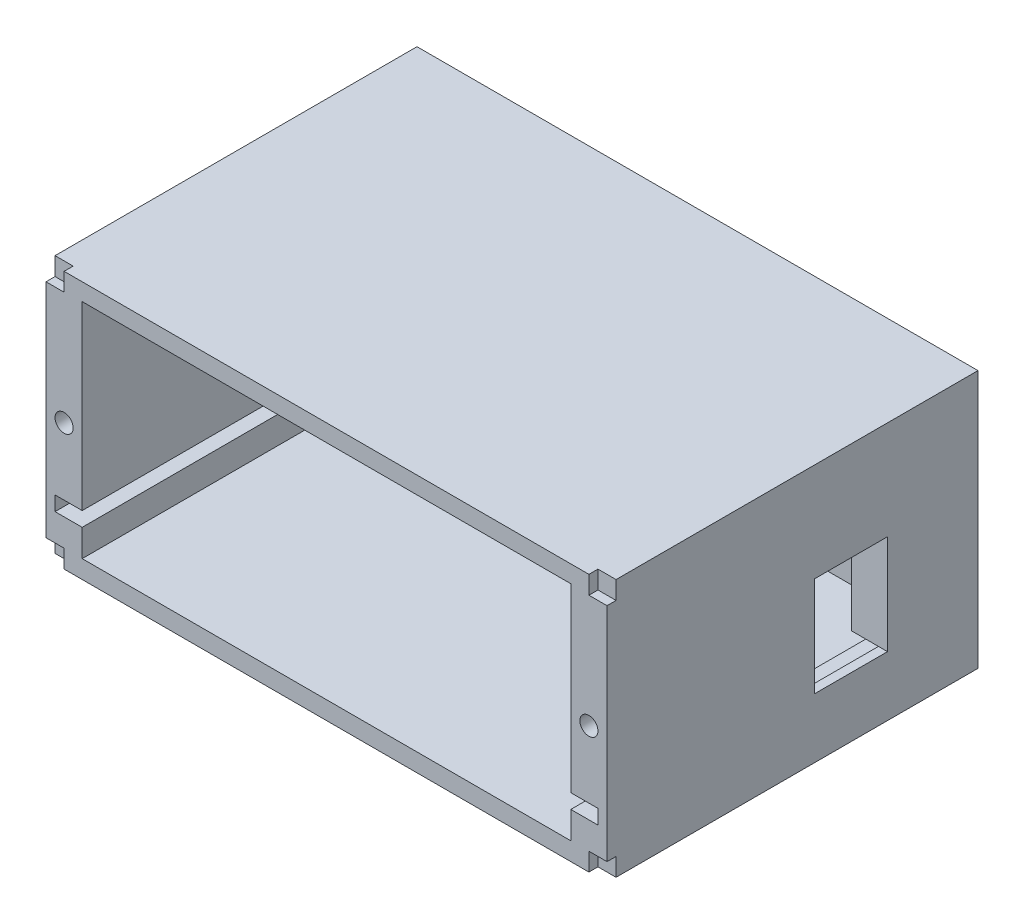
ISO-10303-21;
HEADER;
FILE_DESCRIPTION(('STEP AP214'),'2;1');
FILE_NAME('part.step','',(''),(''),'','','');
FILE_SCHEMA(('AUTOMOTIVE_DESIGN { 1 0 10303 214 1 1 1 1 }'));
ENDSEC;
DATA;
#1=APPLICATION_CONTEXT('core data for automotive mechanical design processes');
#2=APPLICATION_PROTOCOL_DEFINITION('international standard','automotive_design',2000,#1);
#3=PRODUCT_CONTEXT('',#1,'mechanical');
#4=PRODUCT('Part','Part','',(#3));
#5=PRODUCT_RELATED_PRODUCT_CATEGORY('part','',(#4));
#6=PRODUCT_DEFINITION_FORMATION('','',#4);
#7=PRODUCT_DEFINITION_CONTEXT('part definition',#1,'design');
#8=PRODUCT_DEFINITION('design','',#6,#7);
#9=PRODUCT_DEFINITION_SHAPE('','',#8);
#10=(LENGTH_UNIT() NAMED_UNIT(*) SI_UNIT(.MILLI.,.METRE.));
#11=(NAMED_UNIT(*) PLANE_ANGLE_UNIT() SI_UNIT($,.RADIAN.));
#12=(NAMED_UNIT(*) SI_UNIT($,.STERADIAN.) SOLID_ANGLE_UNIT());
#13=UNCERTAINTY_MEASURE_WITH_UNIT(LENGTH_MEASURE(1.E-05),#10,'distance_accuracy_value','');
#14=(GEOMETRIC_REPRESENTATION_CONTEXT(3) GLOBAL_UNCERTAINTY_ASSIGNED_CONTEXT((#13)) GLOBAL_UNIT_ASSIGNED_CONTEXT((#10,
#11,#12)) REPRESENTATION_CONTEXT('',''));
#15=CARTESIAN_POINT('',(0.,0.,0.));
#16=DIRECTION('',(0.,0.,1.));
#17=DIRECTION('',(1.,0.,0.));
#18=AXIS2_PLACEMENT_3D('',#15,#16,#17);
#19=CARTESIAN_POINT('',(-31.,0.,-41.));
#20=DIRECTION('',(0.,-1.,0.));
#21=DIRECTION('',(0.,0.,-1.));
#22=AXIS2_PLACEMENT_3D('',#19,#20,#21);
#23=PLANE('',#22);
#24=CARTESIAN_POINT('',(27.2034715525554,0.,-36.1384335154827));
#25=DIRECTION('',(0.,-1.,0.));
#26=DIRECTION('',(0.,0.,-1.));
#27=AXIS2_PLACEMENT_3D('',#24,#25,#26);
#28=CIRCLE('',#27,2.);
#29=CARTESIAN_POINT('',(27.2034715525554,0.,-38.1384335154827));
#30=VERTEX_POINT('',#29);
#31=EDGE_CURVE('E830',#30,#30,#28,.T.);
#32=ORIENTED_EDGE('',*,*,#31,.F.);
#33=EDGE_LOOP('',(#32));
#34=FACE_BOUND('',#33,.T.);
#35=CARTESIAN_POINT('',(-27.2034715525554,0.,-4.32406514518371));
#36=DIRECTION('',(0.,-1.,0.));
#37=DIRECTION('',(0.,0.,-1.));
#38=AXIS2_PLACEMENT_3D('',#35,#36,#37);
#39=CIRCLE('',#38,2.);
#40=CARTESIAN_POINT('',(-27.2034715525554,0.,-6.32406514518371));
#41=VERTEX_POINT('',#40);
#42=EDGE_CURVE('E823',#41,#41,#39,.T.);
#43=ORIENTED_EDGE('',*,*,#42,.F.);
#44=EDGE_LOOP('',(#43));
#45=FACE_BOUND('',#44,.T.);
#46=DIRECTION('',(0.,0.,1.));
#47=VECTOR('',#46,1.);
#48=CARTESIAN_POINT('',(29.,0.,-1.));
#49=LINE('',#48,#47);
#50=CARTESIAN_POINT('',(29.,0.,-1.));
#51=VERTEX_POINT('',#50);
#52=CARTESIAN_POINT('',(29.,0.,0.));
#53=VERTEX_POINT('',#52);
#54=EDGE_CURVE('E314',#51,#53,#49,.T.);
#55=ORIENTED_EDGE('',*,*,#54,.T.);
#56=DIRECTION('',(1.,0.,0.));
#57=VECTOR('',#56,1.);
#58=CARTESIAN_POINT('',(-31.,0.,0.));
#59=LINE('',#58,#57);
#60=CARTESIAN_POINT('',(-29.,0.,0.));
#61=VERTEX_POINT('',#60);
#62=EDGE_CURVE('E480',#61,#53,#59,.T.);
#63=ORIENTED_EDGE('',*,*,#62,.F.);
#64=DIRECTION('',(0.,0.,1.));
#65=VECTOR('',#64,1.);
#66=CARTESIAN_POINT('',(-29.,0.,-1.));
#67=LINE('',#66,#65);
#68=CARTESIAN_POINT('',(-29.,0.,-1.));
#69=VERTEX_POINT('',#68);
#70=EDGE_CURVE('E333',#69,#61,#67,.T.);
#71=ORIENTED_EDGE('',*,*,#70,.F.);
#72=DIRECTION('',(1.,0.,0.));
#73=VECTOR('',#72,1.);
#74=CARTESIAN_POINT('',(-31.,0.,-1.));
#75=LINE('',#74,#73);
#76=CARTESIAN_POINT('',(-31.,0.,-1.));
#77=VERTEX_POINT('',#76);
#78=EDGE_CURVE('E323',#77,#69,#75,.T.);
#79=ORIENTED_EDGE('',*,*,#78,.F.);
#80=DIRECTION('',(0.,0.,1.));
#81=VECTOR('',#80,1.);
#82=CARTESIAN_POINT('',(-31.,0.,-41.));
#83=LINE('',#82,#81);
#84=CARTESIAN_POINT('',(-31.,0.,-41.));
#85=VERTEX_POINT('',#84);
#86=EDGE_CURVE('E503',#85,#77,#83,.T.);
#87=ORIENTED_EDGE('',*,*,#86,.F.);
#88=DIRECTION('',(1.,0.,0.));
#89=VECTOR('',#88,1.);
#90=CARTESIAN_POINT('',(-31.,0.,-41.));
#91=LINE('',#90,#89);
#92=CARTESIAN_POINT('',(31.,0.,-41.));
#93=VERTEX_POINT('',#92);
#94=EDGE_CURVE('E486',#85,#93,#91,.T.);
#95=ORIENTED_EDGE('',*,*,#94,.T.);
#96=DIRECTION('',(0.,0.,1.));
#97=VECTOR('',#96,1.);
#98=CARTESIAN_POINT('',(31.,0.,-41.));
#99=LINE('',#98,#97);
#100=CARTESIAN_POINT('',(31.,0.,-1.));
#101=VERTEX_POINT('',#100);
#102=EDGE_CURVE('E499',#93,#101,#99,.T.);
#103=ORIENTED_EDGE('',*,*,#102,.T.);
#104=DIRECTION('',(1.,0.,0.));
#105=VECTOR('',#104,1.);
#106=CARTESIAN_POINT('',(31.,0.,-1.));
#107=LINE('',#106,#105);
#108=EDGE_CURVE('E308',#51,#101,#107,.T.);
#109=ORIENTED_EDGE('',*,*,#108,.F.);
#110=EDGE_LOOP('',(#55,#63,#71,#79,#87,#95,#103,#109));
#111=FACE_BOUND('',#110,.T.);
#112=CARTESIAN_POINT('',(-27.2034715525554,0.,-36.1384335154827));
#113=DIRECTION('',(0.,-1.,0.));
#114=DIRECTION('',(0.,0.,1.));
#115=AXIS2_PLACEMENT_3D('',#112,#113,#114);
#116=CIRCLE('',#115,2.);
#117=CARTESIAN_POINT('',(-27.2034715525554,0.,-34.1384335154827));
#118=VERTEX_POINT('',#117);
#119=EDGE_CURVE('E825',#118,#118,#116,.T.);
#120=ORIENTED_EDGE('',*,*,#119,.F.);
#121=EDGE_LOOP('',(#120));
#122=FACE_BOUND('',#121,.T.);
#123=CARTESIAN_POINT('',(27.2034715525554,0.,-4.32406514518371));
#124=DIRECTION('',(0.,-1.,0.));
#125=DIRECTION('',(0.,0.,1.));
#126=AXIS2_PLACEMENT_3D('',#123,#124,#125);
#127=CIRCLE('',#126,2.);
#128=CARTESIAN_POINT('',(27.2034715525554,0.,-2.32406514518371));
#129=VERTEX_POINT('',#128);
#130=EDGE_CURVE('E833',#129,#129,#127,.T.);
#131=ORIENTED_EDGE('',*,*,#130,.F.);
#132=EDGE_LOOP('',(#131));
#133=FACE_BOUND('',#132,.T.);
#134=ADVANCED_FACE('F31',(#34,#45,#111,#122,#133),#23,.T.);
#135=CARTESIAN_POINT('',(0.,6.6,-40.));
#136=DIRECTION('',(0.,1.,0.));
#137=DIRECTION('',(0.,0.,1.));
#138=AXIS2_PLACEMENT_3D('',#135,#136,#137);
#139=PLANE('',#138);
#140=DIRECTION('',(0.,0.,1.));
#141=VECTOR('',#140,1.);
#142=CARTESIAN_POINT('',(27.,6.6,-40.));
#143=LINE('',#142,#141);
#144=CARTESIAN_POINT('',(27.,6.6,-22.9381227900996));
#145=VERTEX_POINT('',#144);
#146=CARTESIAN_POINT('',(27.,6.6,0.));
#147=VERTEX_POINT('',#146);
#148=EDGE_CURVE('E452',#145,#147,#143,.T.);
#149=ORIENTED_EDGE('',*,*,#148,.F.);
#150=DIRECTION('',(1.,0.,0.));
#151=VECTOR('',#150,1.);
#152=CARTESIAN_POINT('',(25.5,6.6,-22.9381227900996));
#153=LINE('',#152,#151);
#154=CARTESIAN_POINT('',(30.,6.6,-22.9381227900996));
#155=VERTEX_POINT('',#154);
#156=EDGE_CURVE('E253',#145,#155,#153,.T.);
#157=ORIENTED_EDGE('',*,*,#156,.T.);
#158=DIRECTION('',(0.,0.,1.));
#159=VECTOR('',#158,1.);
#160=CARTESIAN_POINT('',(30.,6.6,-40.));
#161=LINE('',#160,#159);
#162=CARTESIAN_POINT('',(30.,6.6,0.));
#163=VERTEX_POINT('',#162);
#164=EDGE_CURVE('E457',#155,#163,#161,.T.);
#165=ORIENTED_EDGE('',*,*,#164,.T.);
#166=DIRECTION('',(-1.,0.,0.));
#167=VECTOR('',#166,1.);
#168=CARTESIAN_POINT('',(0.,6.6,0.));
#169=LINE('',#168,#167);
#170=EDGE_CURVE('E441',#163,#147,#169,.T.);
#171=ORIENTED_EDGE('',*,*,#170,.T.);
#172=EDGE_LOOP('',(#149,#157,#165,#171));
#173=FACE_BOUND('',#172,.T.);
#174=ADVANCED_FACE('F550',(#173),#139,.F.);
#175=CARTESIAN_POINT('',(31.,0.,-41.));
#176=DIRECTION('',(1.,0.,0.));
#177=DIRECTION('',(0.,0.,-1.));
#178=AXIS2_PLACEMENT_3D('',#175,#176,#177);
#179=PLANE('',#178);
#180=DIRECTION('',(0.,-1.,0.));
#181=VECTOR('',#180,1.);
#182=CARTESIAN_POINT('',(31.,14.25,-22.9381227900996));
#183=LINE('',#182,#181);
#184=CARTESIAN_POINT('',(31.,17.6,-22.9381227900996));
#185=VERTEX_POINT('',#184);
#186=CARTESIAN_POINT('',(31.,6.6,-22.9381227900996));
#187=VERTEX_POINT('',#186);
#188=EDGE_CURVE('E46',#185,#187,#183,.T.);
#189=ORIENTED_EDGE('',*,*,#188,.F.);
#190=DIRECTION('',(0.,0.,-1.));
#191=VECTOR('',#190,1.);
#192=CARTESIAN_POINT('',(31.,17.6,-31.));
#193=LINE('',#192,#191);
#194=CARTESIAN_POINT('',(31.,17.6,-31.));
#195=VERTEX_POINT('',#194);
#196=EDGE_CURVE('E264',#185,#195,#193,.T.);
#197=ORIENTED_EDGE('',*,*,#196,.T.);
#198=DIRECTION('',(0.,1.,0.));
#199=VECTOR('',#198,1.);
#200=CARTESIAN_POINT('',(31.,14.25,-31.));
#201=LINE('',#200,#199);
#202=CARTESIAN_POINT('',(31.,6.6,-31.));
#203=VERTEX_POINT('',#202);
#204=EDGE_CURVE('E54',#203,#195,#201,.T.);
#205=ORIENTED_EDGE('',*,*,#204,.F.);
#206=DIRECTION('',(0.,0.,-1.));
#207=VECTOR('',#206,1.);
#208=CARTESIAN_POINT('',(31.,6.6,-59.4797561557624));
#209=LINE('',#208,#207);
#210=EDGE_CURVE('E256',#187,#203,#209,.T.);
#211=ORIENTED_EDGE('',*,*,#210,.F.);
#212=EDGE_LOOP('',(#189,#197,#205,#211));
#213=FACE_BOUND('',#212,.T.);
#214=DIRECTION('',(0.,0.,1.));
#215=VECTOR('',#214,1.);
#216=CARTESIAN_POINT('',(31.,26.5,-1.));
#217=LINE('',#216,#215);
#218=CARTESIAN_POINT('',(31.,26.5,-1.));
#219=VERTEX_POINT('',#218);
#220=CARTESIAN_POINT('',(31.,26.5,0.));
#221=VERTEX_POINT('',#220);
#222=EDGE_CURVE('E291',#219,#221,#217,.T.);
#223=ORIENTED_EDGE('',*,*,#222,.T.);
#224=DIRECTION('',(0.,1.,0.));
#225=VECTOR('',#224,1.);
#226=CARTESIAN_POINT('',(31.,0.,0.));
#227=LINE('',#226,#225);
#228=CARTESIAN_POINT('',(31.,2.,0.));
#229=VERTEX_POINT('',#228);
#230=EDGE_CURVE('E448',#229,#221,#227,.T.);
#231=ORIENTED_EDGE('',*,*,#230,.F.);
#232=DIRECTION('',(0.,0.,1.));
#233=VECTOR('',#232,1.);
#234=CARTESIAN_POINT('',(31.,2.,-1.));
#235=LINE('',#234,#233);
#236=CARTESIAN_POINT('',(31.,2.,-1.));
#237=VERTEX_POINT('',#236);
#238=EDGE_CURVE('E310',#237,#229,#235,.T.);
#239=ORIENTED_EDGE('',*,*,#238,.F.);
#240=DIRECTION('',(0.,1.,0.));
#241=VECTOR('',#240,1.);
#242=CARTESIAN_POINT('',(31.,0.,-1.));
#243=LINE('',#242,#241);
#244=EDGE_CURVE('E298',#101,#237,#243,.T.);
#245=ORIENTED_EDGE('',*,*,#244,.F.);
#246=ORIENTED_EDGE('',*,*,#102,.F.);
#247=DIRECTION('',(0.,1.,0.));
#248=VECTOR('',#247,1.);
#249=CARTESIAN_POINT('',(31.,0.,-41.));
#250=LINE('',#249,#248);
#251=CARTESIAN_POINT('',(31.,28.5,-41.));
#252=VERTEX_POINT('',#251);
#253=EDGE_CURVE('E476',#93,#252,#250,.T.);
#254=ORIENTED_EDGE('',*,*,#253,.T.);
#255=DIRECTION('',(0.,0.,1.));
#256=VECTOR('',#255,1.);
#257=CARTESIAN_POINT('',(31.,28.5,-41.));
#258=LINE('',#257,#256);
#259=CARTESIAN_POINT('',(31.,28.5,-1.));
#260=VERTEX_POINT('',#259);
#261=EDGE_CURVE('E489',#252,#260,#258,.T.);
#262=ORIENTED_EDGE('',*,*,#261,.T.);
#263=DIRECTION('',(0.,1.,0.));
#264=VECTOR('',#263,1.);
#265=CARTESIAN_POINT('',(31.,28.5,-1.));
#266=LINE('',#265,#264);
#267=EDGE_CURVE('E275',#219,#260,#266,.T.);
#268=ORIENTED_EDGE('',*,*,#267,.F.);
#269=EDGE_LOOP('',(#223,#231,#239,#245,#246,#254,#262,#268));
#270=FACE_BOUND('',#269,.T.);
#271=ADVANCED_FACE('F261',(#213,#270),#179,.T.);
#272=CARTESIAN_POINT('',(-31.,0.,-41.));
#273=DIRECTION('',(-1.,0.,0.));
#274=DIRECTION('',(0.,0.,1.));
#275=AXIS2_PLACEMENT_3D('',#272,#273,#274);
#276=PLANE('',#275);
#277=DIRECTION('',(0.,0.,1.));
#278=VECTOR('',#277,1.);
#279=CARTESIAN_POINT('',(-31.,2.,-1.));
#280=LINE('',#279,#278);
#281=CARTESIAN_POINT('',(-31.,2.,-1.));
#282=VERTEX_POINT('',#281);
#283=CARTESIAN_POINT('',(-31.,2.,0.));
#284=VERTEX_POINT('',#283);
#285=EDGE_CURVE('E337',#282,#284,#280,.T.);
#286=ORIENTED_EDGE('',*,*,#285,.T.);
#287=DIRECTION('',(0.,-1.,0.));
#288=VECTOR('',#287,1.);
#289=CARTESIAN_POINT('',(-31.,0.,0.));
#290=LINE('',#289,#288);
#291=CARTESIAN_POINT('',(-31.,26.5,0.));
#292=VERTEX_POINT('',#291);
#293=EDGE_CURVE('E494',#292,#284,#290,.T.);
#294=ORIENTED_EDGE('',*,*,#293,.F.);
#295=DIRECTION('',(0.,0.,1.));
#296=VECTOR('',#295,1.);
#297=CARTESIAN_POINT('',(-31.,26.5,-1.));
#298=LINE('',#297,#296);
#299=CARTESIAN_POINT('',(-31.,26.5,-1.));
#300=VERTEX_POINT('',#299);
#301=EDGE_CURVE('E356',#300,#292,#298,.T.);
#302=ORIENTED_EDGE('',*,*,#301,.F.);
#303=DIRECTION('',(0.,-1.,0.));
#304=VECTOR('',#303,1.);
#305=CARTESIAN_POINT('',(-31.,28.5,-1.));
#306=LINE('',#305,#304);
#307=CARTESIAN_POINT('',(-31.,28.5,-1.));
#308=VERTEX_POINT('',#307);
#309=EDGE_CURVE('E344',#308,#300,#306,.T.);
#310=ORIENTED_EDGE('',*,*,#309,.F.);
#311=DIRECTION('',(0.,0.,1.));
#312=VECTOR('',#311,1.);
#313=CARTESIAN_POINT('',(-31.,28.5,-41.));
#314=LINE('',#313,#312);
#315=CARTESIAN_POINT('',(-31.,28.5,-41.));
#316=VERTEX_POINT('',#315);
#317=EDGE_CURVE('E506',#316,#308,#314,.T.);
#318=ORIENTED_EDGE('',*,*,#317,.F.);
#319=DIRECTION('',(0.,-1.,0.));
#320=VECTOR('',#319,1.);
#321=CARTESIAN_POINT('',(-31.,0.,-41.));
#322=LINE('',#321,#320);
#323=EDGE_CURVE('E483',#316,#85,#322,.T.);
#324=ORIENTED_EDGE('',*,*,#323,.T.);
#325=ORIENTED_EDGE('',*,*,#86,.T.);
#326=DIRECTION('',(0.,-1.,0.));
#327=VECTOR('',#326,1.);
#328=CARTESIAN_POINT('',(-31.,0.,-1.));
#329=LINE('',#328,#327);
#330=EDGE_CURVE('E321',#282,#77,#329,.T.);
#331=ORIENTED_EDGE('',*,*,#330,.F.);
#332=EDGE_LOOP('',(#286,#294,#302,#310,#318,#324,#325,#331));
#333=FACE_BOUND('',#332,.T.);
#334=ADVANCED_FACE('F565',(#333),#276,.T.);
#335=CARTESIAN_POINT('',(31.,28.5,-41.));
#336=DIRECTION('',(0.,1.,0.));
#337=DIRECTION('',(0.,0.,1.));
#338=AXIS2_PLACEMENT_3D('',#335,#336,#337);
#339=PLANE('',#338);
#340=DIRECTION('',(0.,0.,1.));
#341=VECTOR('',#340,1.);
#342=CARTESIAN_POINT('',(29.,28.5,-1.));
#343=LINE('',#342,#341);
#344=CARTESIAN_POINT('',(29.,28.5,-1.));
#345=VERTEX_POINT('',#344);
#346=CARTESIAN_POINT('',(29.,28.5,0.));
#347=VERTEX_POINT('',#346);
#348=EDGE_CURVE('E287',#345,#347,#343,.T.);
#349=ORIENTED_EDGE('',*,*,#348,.F.);
#350=DIRECTION('',(-1.,0.,0.));
#351=VECTOR('',#350,1.);
#352=CARTESIAN_POINT('',(31.,28.5,-1.));
#353=LINE('',#352,#351);
#354=EDGE_CURVE('E277',#260,#345,#353,.T.);
#355=ORIENTED_EDGE('',*,*,#354,.F.);
#356=ORIENTED_EDGE('',*,*,#261,.F.);
#357=DIRECTION('',(-1.,0.,0.));
#358=VECTOR('',#357,1.);
#359=CARTESIAN_POINT('',(31.,28.5,-41.));
#360=LINE('',#359,#358);
#361=EDGE_CURVE('E479',#252,#316,#360,.T.);
#362=ORIENTED_EDGE('',*,*,#361,.T.);
#363=ORIENTED_EDGE('',*,*,#317,.T.);
#364=DIRECTION('',(-1.,0.,0.));
#365=VECTOR('',#364,1.);
#366=CARTESIAN_POINT('',(-31.,28.5,-1.));
#367=LINE('',#366,#365);
#368=CARTESIAN_POINT('',(-29.,28.5,-1.));
#369=VERTEX_POINT('',#368);
#370=EDGE_CURVE('E354',#369,#308,#367,.T.);
#371=ORIENTED_EDGE('',*,*,#370,.F.);
#372=DIRECTION('',(0.,0.,1.));
#373=VECTOR('',#372,1.);
#374=CARTESIAN_POINT('',(-29.,28.5,-1.));
#375=LINE('',#374,#373);
#376=CARTESIAN_POINT('',(-29.,28.5,0.));
#377=VERTEX_POINT('',#376);
#378=EDGE_CURVE('E361',#369,#377,#375,.T.);
#379=ORIENTED_EDGE('',*,*,#378,.T.);
#380=DIRECTION('',(-1.,0.,0.));
#381=VECTOR('',#380,1.);
#382=CARTESIAN_POINT('',(31.,28.5,0.));
#383=LINE('',#382,#381);
#384=EDGE_CURVE('E492',#347,#377,#383,.T.);
#385=ORIENTED_EDGE('',*,*,#384,.F.);
#386=EDGE_LOOP('',(#349,#355,#356,#362,#363,#371,#379,#385));
#387=FACE_BOUND('',#386,.T.);
#388=ADVANCED_FACE('F568',(#387),#339,.T.);
#389=CARTESIAN_POINT('',(31.,28.5,-41.));
#390=DIRECTION('',(0.,0.,1.));
#391=DIRECTION('',(1.,0.,0.));
#392=AXIS2_PLACEMENT_3D('',#389,#390,#391);
#393=PLANE('',#392);
#394=ORIENTED_EDGE('',*,*,#253,.F.);
#395=ORIENTED_EDGE('',*,*,#94,.F.);
#396=ORIENTED_EDGE('',*,*,#323,.F.);
#397=ORIENTED_EDGE('',*,*,#361,.F.);
#398=EDGE_LOOP('',(#394,#395,#396,#397));
#399=FACE_BOUND('',#398,.T.);
#400=ADVANCED_FACE('F572',(#399),#393,.F.);
#401=CARTESIAN_POINT('',(31.,28.5,0.));
#402=DIRECTION('',(0.,0.,1.));
#403=DIRECTION('',(1.,0.,0.));
#404=AXIS2_PLACEMENT_3D('',#401,#402,#403);
#405=PLANE('',#404);
#406=DIRECTION('',(1.,0.,0.));
#407=VECTOR('',#406,1.);
#408=CARTESIAN_POINT('',(31.,26.5,0.));
#409=LINE('',#408,#407);
#410=CARTESIAN_POINT('',(29.,26.5,0.));
#411=VERTEX_POINT('',#410);
#412=EDGE_CURVE('E278',#411,#221,#409,.T.);
#413=ORIENTED_EDGE('',*,*,#412,.F.);
#414=DIRECTION('',(0.,-1.,0.));
#415=VECTOR('',#414,1.);
#416=CARTESIAN_POINT('',(29.,28.5,0.));
#417=LINE('',#416,#415);
#418=EDGE_CURVE('E274',#347,#411,#417,.T.);
#419=ORIENTED_EDGE('',*,*,#418,.F.);
#420=ORIENTED_EDGE('',*,*,#384,.T.);
#421=DIRECTION('',(0.,1.,0.));
#422=VECTOR('',#421,1.);
#423=CARTESIAN_POINT('',(-29.,28.5,0.));
#424=LINE('',#423,#422);
#425=CARTESIAN_POINT('',(-29.,26.5,0.));
#426=VERTEX_POINT('',#425);
#427=EDGE_CURVE('E348',#426,#377,#424,.T.);
#428=ORIENTED_EDGE('',*,*,#427,.F.);
#429=DIRECTION('',(1.,0.,0.));
#430=VECTOR('',#429,1.);
#431=CARTESIAN_POINT('',(-31.,26.5,0.));
#432=LINE('',#431,#430);
#433=EDGE_CURVE('E340',#292,#426,#432,.T.);
#434=ORIENTED_EDGE('',*,*,#433,.F.);
#435=ORIENTED_EDGE('',*,*,#293,.T.);
#436=DIRECTION('',(-1.,0.,0.));
#437=VECTOR('',#436,1.);
#438=CARTESIAN_POINT('',(-31.,2.,0.));
#439=LINE('',#438,#437);
#440=CARTESIAN_POINT('',(-29.,2.,0.));
#441=VERTEX_POINT('',#440);
#442=EDGE_CURVE('E324',#441,#284,#439,.T.);
#443=ORIENTED_EDGE('',*,*,#442,.F.);
#444=DIRECTION('',(0.,1.,0.));
#445=VECTOR('',#444,1.);
#446=CARTESIAN_POINT('',(-29.,0.,0.));
#447=LINE('',#446,#445);
#448=EDGE_CURVE('E317',#61,#441,#447,.T.);
#449=ORIENTED_EDGE('',*,*,#448,.F.);
#450=ORIENTED_EDGE('',*,*,#62,.T.);
#451=DIRECTION('',(0.,-1.,0.));
#452=VECTOR('',#451,1.);
#453=CARTESIAN_POINT('',(29.,0.,0.));
#454=LINE('',#453,#452);
#455=CARTESIAN_POINT('',(29.,2.,0.));
#456=VERTEX_POINT('',#455);
#457=EDGE_CURVE('E302',#456,#53,#454,.T.);
#458=ORIENTED_EDGE('',*,*,#457,.F.);
#459=DIRECTION('',(-1.,0.,0.));
#460=VECTOR('',#459,1.);
#461=CARTESIAN_POINT('',(31.,2.,0.));
#462=LINE('',#461,#460);
#463=EDGE_CURVE('E294',#229,#456,#462,.T.);
#464=ORIENTED_EDGE('',*,*,#463,.F.);
#465=ORIENTED_EDGE('',*,*,#230,.T.);
#466=EDGE_LOOP('',(#413,#419,#420,#428,#434,#435,#443,#449,#450,#458,#464,#465));
#467=FACE_BOUND('',#466,.T.);
#468=CARTESIAN_POINT('',(-29.,14.,0.));
#469=DIRECTION('',(0.,0.,1.));
#470=DIRECTION('',(1.,0.,0.));
#471=AXIS2_PLACEMENT_3D('',#468,#469,#470);
#472=CIRCLE('',#471,1.);
#473=CARTESIAN_POINT('',(-28.,14.,0.));
#474=VERTEX_POINT('',#473);
#475=EDGE_CURVE('E364',#474,#474,#472,.T.);
#476=ORIENTED_EDGE('',*,*,#475,.F.);
#477=EDGE_LOOP('',(#476));
#478=FACE_BOUND('',#477,.T.);
#479=CARTESIAN_POINT('',(29.,14.,0.));
#480=DIRECTION('',(0.,0.,1.));
#481=DIRECTION('',(1.,0.,0.));
#482=AXIS2_PLACEMENT_3D('',#479,#480,#481);
#483=CIRCLE('',#482,1.);
#484=CARTESIAN_POINT('',(30.,14.,0.));
#485=VERTEX_POINT('',#484);
#486=EDGE_CURVE('E371',#485,#485,#483,.T.);
#487=ORIENTED_EDGE('',*,*,#486,.F.);
#488=EDGE_LOOP('',(#487));
#489=FACE_BOUND('',#488,.T.);
#490=DIRECTION('',(-1.,0.,0.));
#491=VECTOR('',#490,1.);
#492=CARTESIAN_POINT('',(0.,26.6,0.));
#493=LINE('',#492,#491);
#494=CARTESIAN_POINT('',(27.,26.6,0.));
#495=VERTEX_POINT('',#494);
#496=CARTESIAN_POINT('',(-27.,26.6,0.));
#497=VERTEX_POINT('',#496);
#498=EDGE_CURVE('E377',#495,#497,#493,.T.);
#499=ORIENTED_EDGE('',*,*,#498,.F.);
#500=DIRECTION('',(0.,1.,0.));
#501=VECTOR('',#500,1.);
#502=CARTESIAN_POINT('',(27.,-38.967133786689,0.));
#503=LINE('',#502,#501);
#504=EDGE_CURVE('E384',#147,#495,#503,.T.);
#505=ORIENTED_EDGE('',*,*,#504,.F.);
#506=ORIENTED_EDGE('',*,*,#170,.F.);
#507=DIRECTION('',(0.,1.,0.));
#508=VECTOR('',#507,1.);
#509=CARTESIAN_POINT('',(30.,-38.967133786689,0.));
#510=LINE('',#509,#508);
#511=CARTESIAN_POINT('',(30.,5.,0.));
#512=VERTEX_POINT('',#511);
#513=EDGE_CURVE('E438',#512,#163,#510,.T.);
#514=ORIENTED_EDGE('',*,*,#513,.F.);
#515=DIRECTION('',(1.,0.,0.));
#516=VECTOR('',#515,1.);
#517=CARTESIAN_POINT('',(0.,5.,0.));
#518=LINE('',#517,#516);
#519=CARTESIAN_POINT('',(27.,5.,0.));
#520=VERTEX_POINT('',#519);
#521=EDGE_CURVE('E435',#520,#512,#518,.T.);
#522=ORIENTED_EDGE('',*,*,#521,.F.);
#523=DIRECTION('',(0.,1.,0.));
#524=VECTOR('',#523,1.);
#525=CARTESIAN_POINT('',(27.,-38.967133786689,0.));
#526=LINE('',#525,#524);
#527=CARTESIAN_POINT('',(27.,2.,0.));
#528=VERTEX_POINT('',#527);
#529=EDGE_CURVE('E432',#528,#520,#526,.T.);
#530=ORIENTED_EDGE('',*,*,#529,.F.);
#531=DIRECTION('',(1.,0.,0.));
#532=VECTOR('',#531,1.);
#533=CARTESIAN_POINT('',(0.,2.,0.));
#534=LINE('',#533,#532);
#535=CARTESIAN_POINT('',(-27.,2.,0.));
#536=VERTEX_POINT('',#535);
#537=EDGE_CURVE('E429',#536,#528,#534,.T.);
#538=ORIENTED_EDGE('',*,*,#537,.F.);
#539=DIRECTION('',(0.,1.,0.));
#540=VECTOR('',#539,1.);
#541=CARTESIAN_POINT('',(-27.,-38.967133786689,0.));
#542=LINE('',#541,#540);
#543=CARTESIAN_POINT('',(-27.,5.,0.));
#544=VERTEX_POINT('',#543);
#545=EDGE_CURVE('E426',#536,#544,#542,.T.);
#546=ORIENTED_EDGE('',*,*,#545,.T.);
#547=DIRECTION('',(-1.,0.,0.));
#548=VECTOR('',#547,1.);
#549=CARTESIAN_POINT('',(0.,5.,0.));
#550=LINE('',#549,#548);
#551=CARTESIAN_POINT('',(-30.,5.,0.));
#552=VERTEX_POINT('',#551);
#553=EDGE_CURVE('E423',#544,#552,#550,.T.);
#554=ORIENTED_EDGE('',*,*,#553,.T.);
#555=DIRECTION('',(0.,1.,0.));
#556=VECTOR('',#555,1.);
#557=CARTESIAN_POINT('',(-30.,-38.967133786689,0.));
#558=LINE('',#557,#556);
#559=CARTESIAN_POINT('',(-30.,6.6,0.));
#560=VERTEX_POINT('',#559);
#561=EDGE_CURVE('E420',#552,#560,#558,.T.);
#562=ORIENTED_EDGE('',*,*,#561,.T.);
#563=DIRECTION('',(1.,0.,0.));
#564=VECTOR('',#563,1.);
#565=CARTESIAN_POINT('',(0.,6.6,0.));
#566=LINE('',#565,#564);
#567=CARTESIAN_POINT('',(-27.,6.6,0.));
#568=VERTEX_POINT('',#567);
#569=EDGE_CURVE('E417',#560,#568,#566,.T.);
#570=ORIENTED_EDGE('',*,*,#569,.T.);
#571=DIRECTION('',(0.,1.,0.));
#572=VECTOR('',#571,1.);
#573=CARTESIAN_POINT('',(-27.,-38.967133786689,0.));
#574=LINE('',#573,#572);
#575=EDGE_CURVE('E414',#568,#497,#574,.T.);
#576=ORIENTED_EDGE('',*,*,#575,.T.);
#577=EDGE_LOOP('',(#499,#505,#506,#514,#522,#530,#538,#546,#554,#562,#570,#576));
#578=FACE_BOUND('',#577,.T.);
#579=ADVANCED_FACE('F563',(#467,#478,#489,#578),#405,.T.);
#580=CARTESIAN_POINT('',(0.,26.6,-40.));
#581=DIRECTION('',(0.,1.,0.));
#582=DIRECTION('',(0.,0.,1.));
#583=AXIS2_PLACEMENT_3D('',#580,#581,#582);
#584=PLANE('',#583);
#585=ORIENTED_EDGE('',*,*,#498,.T.);
#586=DIRECTION('',(0.,0.,1.));
#587=VECTOR('',#586,1.);
#588=CARTESIAN_POINT('',(-27.,26.6,-40.));
#589=LINE('',#588,#587);
#590=CARTESIAN_POINT('',(-27.,26.6,-40.));
#591=VERTEX_POINT('',#590);
#592=EDGE_CURVE('E412',#591,#497,#589,.T.);
#593=ORIENTED_EDGE('',*,*,#592,.F.);
#594=DIRECTION('',(-1.,0.,0.));
#595=VECTOR('',#594,1.);
#596=CARTESIAN_POINT('',(0.,26.6,-40.));
#597=LINE('',#596,#595);
#598=CARTESIAN_POINT('',(27.,26.6,-40.));
#599=VERTEX_POINT('',#598);
#600=EDGE_CURVE('E380',#599,#591,#597,.T.);
#601=ORIENTED_EDGE('',*,*,#600,.F.);
#602=DIRECTION('',(0.,0.,1.));
#603=VECTOR('',#602,1.);
#604=CARTESIAN_POINT('',(27.,26.6,-40.));
#605=LINE('',#604,#603);
#606=EDGE_CURVE('E446',#599,#495,#605,.T.);
#607=ORIENTED_EDGE('',*,*,#606,.T.);
#608=EDGE_LOOP('',(#585,#593,#601,#607));
#609=FACE_BOUND('',#608,.T.);
#610=ADVANCED_FACE('F703',(#609),#584,.F.);
#611=CARTESIAN_POINT('',(27.,-38.967133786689,-40.));
#612=DIRECTION('',(1.,0.,0.));
#613=DIRECTION('',(0.,0.,-1.));
#614=AXIS2_PLACEMENT_3D('',#611,#612,#613);
#615=PLANE('',#614);
#616=DIRECTION('',(0.,0.,1.));
#617=VECTOR('',#616,1.);
#618=CARTESIAN_POINT('',(27.,13.6000000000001,-59.4797561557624));
#619=LINE('',#618,#617);
#620=CARTESIAN_POINT('',(27.,13.6000000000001,-31.));
#621=VERTEX_POINT('',#620);
#622=CARTESIAN_POINT('',(27.,13.6000000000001,-22.9381227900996));
#623=VERTEX_POINT('',#622);
#624=EDGE_CURVE('E502',#621,#623,#619,.T.);
#625=ORIENTED_EDGE('',*,*,#624,.T.);
#626=DIRECTION('',(0.,-1.,0.));
#627=VECTOR('',#626,1.);
#628=CARTESIAN_POINT('',(27.,-38.967133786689,-22.9381227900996));
#629=LINE('',#628,#627);
#630=EDGE_CURVE('E271',#623,#145,#629,.T.);
#631=ORIENTED_EDGE('',*,*,#630,.T.);
#632=ORIENTED_EDGE('',*,*,#148,.T.);
#633=ORIENTED_EDGE('',*,*,#504,.T.);
#634=ORIENTED_EDGE('',*,*,#606,.F.);
#635=DIRECTION('',(0.,1.,0.));
#636=VECTOR('',#635,1.);
#637=CARTESIAN_POINT('',(27.,-38.967133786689,-40.));
#638=LINE('',#637,#636);
#639=CARTESIAN_POINT('',(27.,6.6,-40.));
#640=VERTEX_POINT('',#639);
#641=EDGE_CURVE('E409',#640,#599,#638,.T.);
#642=ORIENTED_EDGE('',*,*,#641,.F.);
#643=CARTESIAN_POINT('',(27.,6.6,-31.));
#644=VERTEX_POINT('',#643);
#645=EDGE_CURVE('E449',#640,#644,#143,.T.);
#646=ORIENTED_EDGE('',*,*,#645,.T.);
#647=DIRECTION('',(0.,1.,0.));
#648=VECTOR('',#647,1.);
#649=CARTESIAN_POINT('',(27.,-38.967133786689,-31.));
#650=LINE('',#649,#648);
#651=EDGE_CURVE('E269',#644,#621,#650,.T.);
#652=ORIENTED_EDGE('',*,*,#651,.T.);
#653=EDGE_LOOP('',(#625,#631,#632,#633,#634,#642,#646,#652));
#654=FACE_BOUND('',#653,.T.);
#655=ADVANCED_FACE('F701',(#654),#615,.F.);
#656=CARTESIAN_POINT('',(30.,6.6,-40.));
#657=VERTEX_POINT('',#656);
#658=CARTESIAN_POINT('',(30.,6.6,-31.));
#659=VERTEX_POINT('',#658);
#660=EDGE_CURVE('E453',#657,#659,#161,.T.);
#661=ORIENTED_EDGE('',*,*,#660,.T.);
#662=DIRECTION('',(1.,0.,0.));
#663=VECTOR('',#662,1.);
#664=CARTESIAN_POINT('',(25.5,6.6,-31.));
#665=LINE('',#664,#663);
#666=EDGE_CURVE('E250',#644,#659,#665,.T.);
#667=ORIENTED_EDGE('',*,*,#666,.F.);
#668=ORIENTED_EDGE('',*,*,#645,.F.);
#669=DIRECTION('',(-1.,0.,0.));
#670=VECTOR('',#669,1.);
#671=CARTESIAN_POINT('',(0.,6.6,-40.));
#672=LINE('',#671,#670);
#673=EDGE_CURVE('E406',#657,#640,#672,.T.);
#674=ORIENTED_EDGE('',*,*,#673,.F.);
#675=EDGE_LOOP('',(#661,#667,#668,#674));
#676=FACE_BOUND('',#675,.T.);
#677=ADVANCED_FACE('F558',(#676),#139,.F.);
#678=CARTESIAN_POINT('',(30.,-38.967133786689,-40.));
#679=DIRECTION('',(1.,0.,0.));
#680=DIRECTION('',(0.,0.,-1.));
#681=AXIS2_PLACEMENT_3D('',#678,#679,#680);
#682=PLANE('',#681);
#683=ORIENTED_EDGE('',*,*,#513,.T.);
#684=ORIENTED_EDGE('',*,*,#164,.F.);
#685=EDGE_CURVE('E456',#659,#155,#161,.T.);
#686=ORIENTED_EDGE('',*,*,#685,.F.);
#687=ORIENTED_EDGE('',*,*,#660,.F.);
#688=DIRECTION('',(0.,1.,0.));
#689=VECTOR('',#688,1.);
#690=CARTESIAN_POINT('',(30.,-38.967133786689,-40.));
#691=LINE('',#690,#689);
#692=CARTESIAN_POINT('',(30.,5.,-40.));
#693=VERTEX_POINT('',#692);
#694=EDGE_CURVE('E403',#693,#657,#691,.T.);
#695=ORIENTED_EDGE('',*,*,#694,.F.);
#696=DIRECTION('',(0.,0.,1.));
#697=VECTOR('',#696,1.);
#698=CARTESIAN_POINT('',(30.,5.,-40.));
#699=LINE('',#698,#697);
#700=EDGE_CURVE('E458',#693,#512,#699,.T.);
#701=ORIENTED_EDGE('',*,*,#700,.T.);
#702=EDGE_LOOP('',(#683,#684,#686,#687,#695,#701));
#703=FACE_BOUND('',#702,.T.);
#704=ADVANCED_FACE('F707',(#703),#682,.F.);
#705=CARTESIAN_POINT('',(0.,5.,-40.));
#706=DIRECTION('',(0.,-1.,0.));
#707=DIRECTION('',(0.,0.,-1.));
#708=AXIS2_PLACEMENT_3D('',#705,#706,#707);
#709=PLANE('',#708);
#710=ORIENTED_EDGE('',*,*,#521,.T.);
#711=ORIENTED_EDGE('',*,*,#700,.F.);
#712=DIRECTION('',(1.,0.,0.));
#713=VECTOR('',#712,1.);
#714=CARTESIAN_POINT('',(0.,5.,-40.));
#715=LINE('',#714,#713);
#716=CARTESIAN_POINT('',(27.,5.,-40.));
#717=VERTEX_POINT('',#716);
#718=EDGE_CURVE('E400',#717,#693,#715,.T.);
#719=ORIENTED_EDGE('',*,*,#718,.F.);
#720=DIRECTION('',(0.,0.,1.));
#721=VECTOR('',#720,1.);
#722=CARTESIAN_POINT('',(27.,5.,-40.));
#723=LINE('',#722,#721);
#724=EDGE_CURVE('E460',#717,#520,#723,.T.);
#725=ORIENTED_EDGE('',*,*,#724,.T.);
#726=EDGE_LOOP('',(#710,#711,#719,#725));
#727=FACE_BOUND('',#726,.T.);
#728=ADVANCED_FACE('F711',(#727),#709,.F.);
#729=CARTESIAN_POINT('',(27.,-38.967133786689,-40.));
#730=DIRECTION('',(1.,0.,0.));
#731=DIRECTION('',(0.,0.,-1.));
#732=AXIS2_PLACEMENT_3D('',#729,#730,#731);
#733=PLANE('',#732);
#734=ORIENTED_EDGE('',*,*,#529,.T.);
#735=ORIENTED_EDGE('',*,*,#724,.F.);
#736=DIRECTION('',(0.,1.,0.));
#737=VECTOR('',#736,1.);
#738=CARTESIAN_POINT('',(27.,-38.967133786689,-40.));
#739=LINE('',#738,#737);
#740=CARTESIAN_POINT('',(27.,2.,-40.));
#741=VERTEX_POINT('',#740);
#742=EDGE_CURVE('E397',#741,#717,#739,.T.);
#743=ORIENTED_EDGE('',*,*,#742,.F.);
#744=DIRECTION('',(0.,0.,1.));
#745=VECTOR('',#744,1.);
#746=CARTESIAN_POINT('',(27.,2.,-40.));
#747=LINE('',#746,#745);
#748=EDGE_CURVE('E462',#741,#528,#747,.T.);
#749=ORIENTED_EDGE('',*,*,#748,.T.);
#750=EDGE_LOOP('',(#734,#735,#743,#749));
#751=FACE_BOUND('',#750,.T.);
#752=ADVANCED_FACE('F715',(#751),#733,.F.);
#753=CARTESIAN_POINT('',(0.,2.,-40.));
#754=DIRECTION('',(0.,-1.,0.));
#755=DIRECTION('',(0.,0.,-1.));
#756=AXIS2_PLACEMENT_3D('',#753,#754,#755);
#757=PLANE('',#756);
#758=ORIENTED_EDGE('',*,*,#537,.T.);
#759=ORIENTED_EDGE('',*,*,#748,.F.);
#760=DIRECTION('',(1.,0.,0.));
#761=VECTOR('',#760,1.);
#762=CARTESIAN_POINT('',(0.,2.,-40.));
#763=LINE('',#762,#761);
#764=CARTESIAN_POINT('',(-27.,2.,-40.));
#765=VERTEX_POINT('',#764);
#766=EDGE_CURVE('E394',#765,#741,#763,.T.);
#767=ORIENTED_EDGE('',*,*,#766,.F.);
#768=DIRECTION('',(0.,0.,1.));
#769=VECTOR('',#768,1.);
#770=CARTESIAN_POINT('',(-27.,2.,-40.));
#771=LINE('',#770,#769);
#772=EDGE_CURVE('E464',#765,#536,#771,.T.);
#773=ORIENTED_EDGE('',*,*,#772,.T.);
#774=EDGE_LOOP('',(#758,#759,#767,#773));
#775=FACE_BOUND('',#774,.T.);
#776=ADVANCED_FACE('F719',(#775),#757,.F.);
#777=CARTESIAN_POINT('',(-27.,-38.967133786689,-40.));
#778=DIRECTION('',(1.,0.,0.));
#779=DIRECTION('',(0.,0.,-1.));
#780=AXIS2_PLACEMENT_3D('',#777,#778,#779);
#781=PLANE('',#780);
#782=ORIENTED_EDGE('',*,*,#545,.F.);
#783=ORIENTED_EDGE('',*,*,#772,.F.);
#784=DIRECTION('',(0.,1.,0.));
#785=VECTOR('',#784,1.);
#786=CARTESIAN_POINT('',(-27.,-38.967133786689,-40.));
#787=LINE('',#786,#785);
#788=CARTESIAN_POINT('',(-27.,5.,-40.));
#789=VERTEX_POINT('',#788);
#790=EDGE_CURVE('E392',#765,#789,#787,.T.);
#791=ORIENTED_EDGE('',*,*,#790,.T.);
#792=DIRECTION('',(0.,0.,1.));
#793=VECTOR('',#792,1.);
#794=CARTESIAN_POINT('',(-27.,5.,-40.));
#795=LINE('',#794,#793);
#796=EDGE_CURVE('E466',#789,#544,#795,.T.);
#797=ORIENTED_EDGE('',*,*,#796,.T.);
#798=EDGE_LOOP('',(#782,#783,#791,#797));
#799=FACE_BOUND('',#798,.T.);
#800=ADVANCED_FACE('F723',(#799),#781,.T.);
#801=CARTESIAN_POINT('',(0.,5.,-40.));
#802=DIRECTION('',(0.,1.,0.));
#803=DIRECTION('',(0.,0.,1.));
#804=AXIS2_PLACEMENT_3D('',#801,#802,#803);
#805=PLANE('',#804);
#806=ORIENTED_EDGE('',*,*,#553,.F.);
#807=ORIENTED_EDGE('',*,*,#796,.F.);
#808=DIRECTION('',(-1.,0.,0.));
#809=VECTOR('',#808,1.);
#810=CARTESIAN_POINT('',(0.,5.,-40.));
#811=LINE('',#810,#809);
#812=CARTESIAN_POINT('',(-30.,5.,-40.));
#813=VERTEX_POINT('',#812);
#814=EDGE_CURVE('E390',#789,#813,#811,.T.);
#815=ORIENTED_EDGE('',*,*,#814,.T.);
#816=DIRECTION('',(0.,0.,1.));
#817=VECTOR('',#816,1.);
#818=CARTESIAN_POINT('',(-30.,5.,-40.));
#819=LINE('',#818,#817);
#820=EDGE_CURVE('E468',#813,#552,#819,.T.);
#821=ORIENTED_EDGE('',*,*,#820,.T.);
#822=EDGE_LOOP('',(#806,#807,#815,#821));
#823=FACE_BOUND('',#822,.T.);
#824=ADVANCED_FACE('F727',(#823),#805,.T.);
#825=CARTESIAN_POINT('',(-30.,-38.967133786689,-40.));
#826=DIRECTION('',(1.,0.,0.));
#827=DIRECTION('',(0.,0.,-1.));
#828=AXIS2_PLACEMENT_3D('',#825,#826,#827);
#829=PLANE('',#828);
#830=ORIENTED_EDGE('',*,*,#561,.F.);
#831=ORIENTED_EDGE('',*,*,#820,.F.);
#832=DIRECTION('',(0.,1.,0.));
#833=VECTOR('',#832,1.);
#834=CARTESIAN_POINT('',(-30.,-38.967133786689,-40.));
#835=LINE('',#834,#833);
#836=CARTESIAN_POINT('',(-30.,6.6,-40.));
#837=VERTEX_POINT('',#836);
#838=EDGE_CURVE('E388',#813,#837,#835,.T.);
#839=ORIENTED_EDGE('',*,*,#838,.T.);
#840=DIRECTION('',(0.,0.,1.));
#841=VECTOR('',#840,1.);
#842=CARTESIAN_POINT('',(-30.,6.6,-40.));
#843=LINE('',#842,#841);
#844=EDGE_CURVE('E470',#837,#560,#843,.T.);
#845=ORIENTED_EDGE('',*,*,#844,.T.);
#846=EDGE_LOOP('',(#830,#831,#839,#845));
#847=FACE_BOUND('',#846,.T.);
#848=ADVANCED_FACE('F731',(#847),#829,.T.);
#849=CARTESIAN_POINT('',(0.,6.6,-40.));
#850=DIRECTION('',(0.,-1.,0.));
#851=DIRECTION('',(0.,0.,-1.));
#852=AXIS2_PLACEMENT_3D('',#849,#850,#851);
#853=PLANE('',#852);
#854=ORIENTED_EDGE('',*,*,#569,.F.);
#855=ORIENTED_EDGE('',*,*,#844,.F.);
#856=DIRECTION('',(1.,0.,0.));
#857=VECTOR('',#856,1.);
#858=CARTESIAN_POINT('',(0.,6.6,-40.));
#859=LINE('',#858,#857);
#860=CARTESIAN_POINT('',(-27.,6.6,-40.));
#861=VERTEX_POINT('',#860);
#862=EDGE_CURVE('E386',#837,#861,#859,.T.);
#863=ORIENTED_EDGE('',*,*,#862,.T.);
#864=DIRECTION('',(0.,0.,1.));
#865=VECTOR('',#864,1.);
#866=CARTESIAN_POINT('',(-27.,6.6,-40.));
#867=LINE('',#866,#865);
#868=EDGE_CURVE('E472',#861,#568,#867,.T.);
#869=ORIENTED_EDGE('',*,*,#868,.T.);
#870=EDGE_LOOP('',(#854,#855,#863,#869));
#871=FACE_BOUND('',#870,.T.);
#872=ADVANCED_FACE('F735',(#871),#853,.T.);
#873=CARTESIAN_POINT('',(-27.,-38.967133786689,-40.));
#874=DIRECTION('',(1.,0.,0.));
#875=DIRECTION('',(0.,0.,-1.));
#876=AXIS2_PLACEMENT_3D('',#873,#874,#875);
#877=PLANE('',#876);
#878=ORIENTED_EDGE('',*,*,#575,.F.);
#879=ORIENTED_EDGE('',*,*,#868,.F.);
#880=DIRECTION('',(0.,1.,0.));
#881=VECTOR('',#880,1.);
#882=CARTESIAN_POINT('',(-27.,-38.967133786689,-40.));
#883=LINE('',#882,#881);
#884=EDGE_CURVE('E383',#861,#591,#883,.T.);
#885=ORIENTED_EDGE('',*,*,#884,.T.);
#886=ORIENTED_EDGE('',*,*,#592,.T.);
#887=EDGE_LOOP('',(#878,#879,#885,#886));
#888=FACE_BOUND('',#887,.T.);
#889=ADVANCED_FACE('F699',(#888),#877,.T.);
#890=CARTESIAN_POINT('',(0.,-38.967133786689,-40.));
#891=DIRECTION('',(0.,0.,1.));
#892=DIRECTION('',(1.,0.,0.));
#893=AXIS2_PLACEMENT_3D('',#890,#891,#892);
#894=PLANE('',#893);
#895=ORIENTED_EDGE('',*,*,#600,.T.);
#896=ORIENTED_EDGE('',*,*,#884,.F.);
#897=ORIENTED_EDGE('',*,*,#862,.F.);
#898=ORIENTED_EDGE('',*,*,#838,.F.);
#899=ORIENTED_EDGE('',*,*,#814,.F.);
#900=ORIENTED_EDGE('',*,*,#790,.F.);
#901=ORIENTED_EDGE('',*,*,#766,.T.);
#902=ORIENTED_EDGE('',*,*,#742,.T.);
#903=ORIENTED_EDGE('',*,*,#718,.T.);
#904=ORIENTED_EDGE('',*,*,#694,.T.);
#905=ORIENTED_EDGE('',*,*,#673,.T.);
#906=ORIENTED_EDGE('',*,*,#641,.T.);
#907=EDGE_LOOP('',(#895,#896,#897,#898,#899,#900,#901,#902,#903,#904,#905,#906));
#908=FACE_BOUND('',#907,.T.);
#909=ADVANCED_FACE('F695',(#908),#894,.T.);
#910=CARTESIAN_POINT('',(29.,14.,-10.));
#911=DIRECTION('',(0.,0.,1.));
#912=DIRECTION('',(1.,0.,0.));
#913=AXIS2_PLACEMENT_3D('',#910,#911,#912);
#914=CYLINDRICAL_SURFACE('',#913,1.);
#915=CARTESIAN_POINT('',(29.,14.,-10.));
#916=DIRECTION('',(0.,0.,1.));
#917=DIRECTION('',(1.,0.,0.));
#918=AXIS2_PLACEMENT_3D('',#915,#916,#917);
#919=CIRCLE('',#918,1.);
#920=CARTESIAN_POINT('',(30.,14.,-10.));
#921=VERTEX_POINT('',#920);
#922=EDGE_CURVE('E374',#921,#921,#919,.T.);
#923=ORIENTED_EDGE('',*,*,#922,.F.);
#924=EDGE_LOOP('',(#923));
#925=FACE_BOUND('',#924,.T.);
#926=ORIENTED_EDGE('',*,*,#486,.T.);
#927=EDGE_LOOP('',(#926));
#928=FACE_BOUND('',#927,.T.);
#929=ADVANCED_FACE('F691',(#925,#928),#914,.F.);
#930=CARTESIAN_POINT('',(29.,14.,-10.));
#931=DIRECTION('',(0.,0.,1.));
#932=DIRECTION('',(1.,0.,0.));
#933=AXIS2_PLACEMENT_3D('',#930,#931,#932);
#934=PLANE('',#933);
#935=ORIENTED_EDGE('',*,*,#922,.T.);
#936=EDGE_LOOP('',(#935));
#937=FACE_BOUND('',#936,.T.);
#938=ADVANCED_FACE('F687',(#937),#934,.T.);
#939=CARTESIAN_POINT('',(-29.,14.,-10.));
#940=DIRECTION('',(0.,0.,1.));
#941=DIRECTION('',(1.,0.,0.));
#942=AXIS2_PLACEMENT_3D('',#939,#940,#941);
#943=CYLINDRICAL_SURFACE('',#942,1.);
#944=CARTESIAN_POINT('',(-29.,14.,-10.));
#945=DIRECTION('',(0.,0.,1.));
#946=DIRECTION('',(1.,0.,0.));
#947=AXIS2_PLACEMENT_3D('',#944,#945,#946);
#948=CIRCLE('',#947,1.);
#949=CARTESIAN_POINT('',(-28.,14.,-10.));
#950=VERTEX_POINT('',#949);
#951=EDGE_CURVE('E368',#950,#950,#948,.T.);
#952=ORIENTED_EDGE('',*,*,#951,.F.);
#953=EDGE_LOOP('',(#952));
#954=FACE_BOUND('',#953,.T.);
#955=ORIENTED_EDGE('',*,*,#475,.T.);
#956=EDGE_LOOP('',(#955));
#957=FACE_BOUND('',#956,.T.);
#958=ADVANCED_FACE('F683',(#954,#957),#943,.F.);
#959=CARTESIAN_POINT('',(-29.,14.,-10.));
#960=DIRECTION('',(0.,0.,1.));
#961=DIRECTION('',(1.,0.,0.));
#962=AXIS2_PLACEMENT_3D('',#959,#960,#961);
#963=PLANE('',#962);
#964=ORIENTED_EDGE('',*,*,#951,.T.);
#965=EDGE_LOOP('',(#964));
#966=FACE_BOUND('',#965,.T.);
#967=ADVANCED_FACE('F676',(#966),#963,.T.);
#968=CARTESIAN_POINT('',(-29.,28.5,-1.));
#969=DIRECTION('',(1.,0.,0.));
#970=DIRECTION('',(0.,0.,-1.));
#971=AXIS2_PLACEMENT_3D('',#968,#969,#970);
#972=PLANE('',#971);
#973=ORIENTED_EDGE('',*,*,#427,.T.);
#974=ORIENTED_EDGE('',*,*,#378,.F.);
#975=DIRECTION('',(0.,1.,0.));
#976=VECTOR('',#975,1.);
#977=CARTESIAN_POINT('',(-29.,28.5,-1.));
#978=LINE('',#977,#976);
#979=CARTESIAN_POINT('',(-29.,26.5,-1.));
#980=VERTEX_POINT('',#979);
#981=EDGE_CURVE('E351',#980,#369,#978,.T.);
#982=ORIENTED_EDGE('',*,*,#981,.F.);
#983=DIRECTION('',(0.,0.,1.));
#984=VECTOR('',#983,1.);
#985=CARTESIAN_POINT('',(-29.,26.5,-1.));
#986=LINE('',#985,#984);
#987=EDGE_CURVE('E365',#980,#426,#986,.T.);
#988=ORIENTED_EDGE('',*,*,#987,.T.);
#989=EDGE_LOOP('',(#973,#974,#982,#988));
#990=FACE_BOUND('',#989,.T.);
#991=ADVANCED_FACE('F673',(#990),#972,.F.);
#992=CARTESIAN_POINT('',(-31.,26.5,-1.));
#993=DIRECTION('',(0.,-1.,0.));
#994=DIRECTION('',(0.,0.,-1.));
#995=AXIS2_PLACEMENT_3D('',#992,#993,#994);
#996=PLANE('',#995);
#997=ORIENTED_EDGE('',*,*,#433,.T.);
#998=ORIENTED_EDGE('',*,*,#987,.F.);
#999=DIRECTION('',(1.,0.,0.));
#1000=VECTOR('',#999,1.);
#1001=CARTESIAN_POINT('',(-31.,26.5,-1.));
#1002=LINE('',#1001,#1000);
#1003=EDGE_CURVE('E347',#300,#980,#1002,.T.);
#1004=ORIENTED_EDGE('',*,*,#1003,.F.);
#1005=ORIENTED_EDGE('',*,*,#301,.T.);
#1006=EDGE_LOOP('',(#997,#998,#1004,#1005));
#1007=FACE_BOUND('',#1006,.T.);
#1008=ADVANCED_FACE('F671',(#1007),#996,.F.);
#1009=CARTESIAN_POINT('',(-31.,26.5,-1.));
#1010=DIRECTION('',(0.,0.,1.));
#1011=DIRECTION('',(1.,0.,0.));
#1012=AXIS2_PLACEMENT_3D('',#1009,#1010,#1011);
#1013=PLANE('',#1012);
#1014=ORIENTED_EDGE('',*,*,#309,.T.);
#1015=ORIENTED_EDGE('',*,*,#1003,.T.);
#1016=ORIENTED_EDGE('',*,*,#981,.T.);
#1017=ORIENTED_EDGE('',*,*,#370,.T.);
#1018=EDGE_LOOP('',(#1014,#1015,#1016,#1017));
#1019=FACE_BOUND('',#1018,.T.);
#1020=ADVANCED_FACE('F664',(#1019),#1013,.T.);
#1021=CARTESIAN_POINT('',(-31.,2.,-1.));
#1022=DIRECTION('',(0.,1.,0.));
#1023=DIRECTION('',(0.,0.,1.));
#1024=AXIS2_PLACEMENT_3D('',#1021,#1022,#1023);
#1025=PLANE('',#1024);
#1026=ORIENTED_EDGE('',*,*,#442,.T.);
#1027=ORIENTED_EDGE('',*,*,#285,.F.);
#1028=DIRECTION('',(-1.,0.,0.));
#1029=VECTOR('',#1028,1.);
#1030=CARTESIAN_POINT('',(-31.,2.,-1.));
#1031=LINE('',#1030,#1029);
#1032=CARTESIAN_POINT('',(-29.,2.,-1.));
#1033=VERTEX_POINT('',#1032);
#1034=EDGE_CURVE('E330',#1033,#282,#1031,.T.);
#1035=ORIENTED_EDGE('',*,*,#1034,.F.);
#1036=DIRECTION('',(0.,0.,1.));
#1037=VECTOR('',#1036,1.);
#1038=CARTESIAN_POINT('',(-29.,2.,-1.));
#1039=LINE('',#1038,#1037);
#1040=EDGE_CURVE('E341',#1033,#441,#1039,.T.);
#1041=ORIENTED_EDGE('',*,*,#1040,.T.);
#1042=EDGE_LOOP('',(#1026,#1027,#1035,#1041));
#1043=FACE_BOUND('',#1042,.T.);
#1044=ADVANCED_FACE('F661',(#1043),#1025,.F.);
#1045=CARTESIAN_POINT('',(-29.,0.,-1.));
#1046=DIRECTION('',(1.,0.,0.));
#1047=DIRECTION('',(0.,0.,-1.));
#1048=AXIS2_PLACEMENT_3D('',#1045,#1046,#1047);
#1049=PLANE('',#1048);
#1050=ORIENTED_EDGE('',*,*,#448,.T.);
#1051=ORIENTED_EDGE('',*,*,#1040,.F.);
#1052=DIRECTION('',(0.,1.,0.));
#1053=VECTOR('',#1052,1.);
#1054=CARTESIAN_POINT('',(-29.,0.,-1.));
#1055=LINE('',#1054,#1053);
#1056=EDGE_CURVE('E327',#69,#1033,#1055,.T.);
#1057=ORIENTED_EDGE('',*,*,#1056,.F.);
#1058=ORIENTED_EDGE('',*,*,#70,.T.);
#1059=EDGE_LOOP('',(#1050,#1051,#1057,#1058));
#1060=FACE_BOUND('',#1059,.T.);
#1061=ADVANCED_FACE('F659',(#1060),#1049,.F.);
#1062=CARTESIAN_POINT('',(-31.,2.,-1.));
#1063=DIRECTION('',(0.,0.,-1.));
#1064=DIRECTION('',(-1.,0.,0.));
#1065=AXIS2_PLACEMENT_3D('',#1062,#1063,#1064);
#1066=PLANE('',#1065);
#1067=ORIENTED_EDGE('',*,*,#330,.T.);
#1068=ORIENTED_EDGE('',*,*,#78,.T.);
#1069=ORIENTED_EDGE('',*,*,#1056,.T.);
#1070=ORIENTED_EDGE('',*,*,#1034,.T.);
#1071=EDGE_LOOP('',(#1067,#1068,#1069,#1070));
#1072=FACE_BOUND('',#1071,.T.);
#1073=ADVANCED_FACE('F652',(#1072),#1066,.F.);
#1074=CARTESIAN_POINT('',(29.,0.,-1.));
#1075=DIRECTION('',(-1.,0.,0.));
#1076=DIRECTION('',(0.,0.,1.));
#1077=AXIS2_PLACEMENT_3D('',#1074,#1075,#1076);
#1078=PLANE('',#1077);
#1079=ORIENTED_EDGE('',*,*,#457,.T.);
#1080=ORIENTED_EDGE('',*,*,#54,.F.);
#1081=DIRECTION('',(0.,-1.,0.));
#1082=VECTOR('',#1081,1.);
#1083=CARTESIAN_POINT('',(29.,0.,-1.));
#1084=LINE('',#1083,#1082);
#1085=CARTESIAN_POINT('',(29.,2.,-1.));
#1086=VERTEX_POINT('',#1085);
#1087=EDGE_CURVE('E305',#1086,#51,#1084,.T.);
#1088=ORIENTED_EDGE('',*,*,#1087,.F.);
#1089=DIRECTION('',(0.,0.,1.));
#1090=VECTOR('',#1089,1.);
#1091=CARTESIAN_POINT('',(29.,2.,-1.));
#1092=LINE('',#1091,#1090);
#1093=EDGE_CURVE('E318',#1086,#456,#1092,.T.);
#1094=ORIENTED_EDGE('',*,*,#1093,.T.);
#1095=EDGE_LOOP('',(#1079,#1080,#1088,#1094));
#1096=FACE_BOUND('',#1095,.T.);
#1097=ADVANCED_FACE('F649',(#1096),#1078,.F.);
#1098=CARTESIAN_POINT('',(31.,2.,-1.));
#1099=DIRECTION('',(0.,1.,0.));
#1100=DIRECTION('',(-1.,0.,0.));
#1101=AXIS2_PLACEMENT_3D('',#1098,#1099,#1100);
#1102=PLANE('',#1101);
#1103=ORIENTED_EDGE('',*,*,#463,.T.);
#1104=ORIENTED_EDGE('',*,*,#1093,.F.);
#1105=DIRECTION('',(-1.,0.,0.));
#1106=VECTOR('',#1105,1.);
#1107=CARTESIAN_POINT('',(31.,2.,-1.));
#1108=LINE('',#1107,#1106);
#1109=EDGE_CURVE('E301',#237,#1086,#1108,.T.);
#1110=ORIENTED_EDGE('',*,*,#1109,.F.);
#1111=ORIENTED_EDGE('',*,*,#238,.T.);
#1112=EDGE_LOOP('',(#1103,#1104,#1110,#1111));
#1113=FACE_BOUND('',#1112,.T.);
#1114=ADVANCED_FACE('F647',(#1113),#1102,.F.);
#1115=CARTESIAN_POINT('',(31.,0.,-1.));
#1116=DIRECTION('',(0.,0.,1.));
#1117=DIRECTION('',(1.,0.,0.));
#1118=AXIS2_PLACEMENT_3D('',#1115,#1116,#1117);
#1119=PLANE('',#1118);
#1120=ORIENTED_EDGE('',*,*,#244,.T.);
#1121=ORIENTED_EDGE('',*,*,#1109,.T.);
#1122=ORIENTED_EDGE('',*,*,#1087,.T.);
#1123=ORIENTED_EDGE('',*,*,#108,.T.);
#1124=EDGE_LOOP('',(#1120,#1121,#1122,#1123));
#1125=FACE_BOUND('',#1124,.T.);
#1126=ADVANCED_FACE('F640',(#1125),#1119,.T.);
#1127=CARTESIAN_POINT('',(31.,26.5,-1.));
#1128=DIRECTION('',(0.,-1.,0.));
#1129=DIRECTION('',(0.,0.,-1.));
#1130=AXIS2_PLACEMENT_3D('',#1127,#1128,#1129);
#1131=PLANE('',#1130);
#1132=ORIENTED_EDGE('',*,*,#412,.T.);
#1133=ORIENTED_EDGE('',*,*,#222,.F.);
#1134=DIRECTION('',(1.,0.,0.));
#1135=VECTOR('',#1134,1.);
#1136=CARTESIAN_POINT('',(31.,26.5,-1.));
#1137=LINE('',#1136,#1135);
#1138=CARTESIAN_POINT('',(29.,26.5,-1.));
#1139=VERTEX_POINT('',#1138);
#1140=EDGE_CURVE('E284',#1139,#219,#1137,.T.);
#1141=ORIENTED_EDGE('',*,*,#1140,.F.);
#1142=DIRECTION('',(0.,0.,1.));
#1143=VECTOR('',#1142,1.);
#1144=CARTESIAN_POINT('',(29.,26.5,-1.));
#1145=LINE('',#1144,#1143);
#1146=EDGE_CURVE('E295',#1139,#411,#1145,.T.);
#1147=ORIENTED_EDGE('',*,*,#1146,.T.);
#1148=EDGE_LOOP('',(#1132,#1133,#1141,#1147));
#1149=FACE_BOUND('',#1148,.T.);
#1150=ADVANCED_FACE('F637',(#1149),#1131,.F.);
#1151=CARTESIAN_POINT('',(29.,28.5,-1.));
#1152=DIRECTION('',(-1.,0.,0.));
#1153=DIRECTION('',(0.,0.,1.));
#1154=AXIS2_PLACEMENT_3D('',#1151,#1152,#1153);
#1155=PLANE('',#1154);
#1156=ORIENTED_EDGE('',*,*,#418,.T.);
#1157=ORIENTED_EDGE('',*,*,#1146,.F.);
#1158=DIRECTION('',(0.,-1.,0.));
#1159=VECTOR('',#1158,1.);
#1160=CARTESIAN_POINT('',(29.,28.5,-1.));
#1161=LINE('',#1160,#1159);
#1162=EDGE_CURVE('E281',#345,#1139,#1161,.T.);
#1163=ORIENTED_EDGE('',*,*,#1162,.F.);
#1164=ORIENTED_EDGE('',*,*,#348,.T.);
#1165=EDGE_LOOP('',(#1156,#1157,#1163,#1164));
#1166=FACE_BOUND('',#1165,.T.);
#1167=ADVANCED_FACE('F635',(#1166),#1155,.F.);
#1168=CARTESIAN_POINT('',(31.,26.5,-1.));
#1169=DIRECTION('',(0.,0.,-1.));
#1170=DIRECTION('',(-1.,0.,0.));
#1171=AXIS2_PLACEMENT_3D('',#1168,#1169,#1170);
#1172=PLANE('',#1171);
#1173=ORIENTED_EDGE('',*,*,#267,.T.);
#1174=ORIENTED_EDGE('',*,*,#354,.T.);
#1175=ORIENTED_EDGE('',*,*,#1162,.T.);
#1176=ORIENTED_EDGE('',*,*,#1140,.T.);
#1177=EDGE_LOOP('',(#1173,#1174,#1175,#1176));
#1178=FACE_BOUND('',#1177,.T.);
#1179=ADVANCED_FACE('F631',(#1178),#1172,.F.);
#1180=CARTESIAN_POINT('',(25.5,14.25,-22.9381227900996));
#1181=DIRECTION('',(0.,0.,1.));
#1182=DIRECTION('',(1.,0.,0.));
#1183=AXIS2_PLACEMENT_3D('',#1180,#1181,#1182);
#1184=PLANE('',#1183);
#1185=ORIENTED_EDGE('',*,*,#630,.F.);
#1186=DIRECTION('',(0.707106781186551,0.707106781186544,0.));
#1187=VECTOR('',#1186,1.);
#1188=CARTESIAN_POINT('',(26.575,13.175,-22.9381227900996));
#1189=LINE('',#1188,#1187);
#1190=EDGE_CURVE('E514',#623,#185,#1189,.T.);
#1191=ORIENTED_EDGE('',*,*,#1190,.T.);
#1192=ORIENTED_EDGE('',*,*,#188,.T.);
#1193=EDGE_CURVE('E259',#155,#187,#153,.T.);
#1194=ORIENTED_EDGE('',*,*,#1193,.F.);
#1195=ORIENTED_EDGE('',*,*,#156,.F.);
#1196=EDGE_LOOP('',(#1185,#1191,#1192,#1194,#1195));
#1197=FACE_BOUND('',#1196,.T.);
#1198=ADVANCED_FACE('F626',(#1197),#1184,.F.);
#1199=CARTESIAN_POINT('',(25.5,14.25,-31.));
#1200=DIRECTION('',(0.,0.,-1.));
#1201=DIRECTION('',(-1.,0.,0.));
#1202=AXIS2_PLACEMENT_3D('',#1199,#1200,#1201);
#1203=PLANE('',#1202);
#1204=ORIENTED_EDGE('',*,*,#666,.T.);
#1205=EDGE_CURVE('E246',#659,#203,#665,.T.);
#1206=ORIENTED_EDGE('',*,*,#1205,.T.);
#1207=ORIENTED_EDGE('',*,*,#204,.T.);
#1208=DIRECTION('',(-0.707106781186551,-0.707106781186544,0.));
#1209=VECTOR('',#1208,1.);
#1210=CARTESIAN_POINT('',(26.575,13.175,-31.));
#1211=LINE('',#1210,#1209);
#1212=EDGE_CURVE('E516',#195,#621,#1211,.T.);
#1213=ORIENTED_EDGE('',*,*,#1212,.T.);
#1214=ORIENTED_EDGE('',*,*,#651,.F.);
#1215=EDGE_LOOP('',(#1204,#1206,#1207,#1213,#1214));
#1216=FACE_BOUND('',#1215,.T.);
#1217=ADVANCED_FACE('F248',(#1216),#1203,.F.);
#1218=CARTESIAN_POINT('',(25.5,6.6,-59.4797561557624));
#1219=DIRECTION('',(0.,-1.,0.));
#1220=DIRECTION('',(0.,0.,-1.));
#1221=AXIS2_PLACEMENT_3D('',#1218,#1219,#1220);
#1222=PLANE('',#1221);
#1223=ORIENTED_EDGE('',*,*,#1193,.T.);
#1224=ORIENTED_EDGE('',*,*,#210,.T.);
#1225=ORIENTED_EDGE('',*,*,#1205,.F.);
#1226=ORIENTED_EDGE('',*,*,#685,.T.);
#1227=EDGE_LOOP('',(#1223,#1224,#1225,#1226));
#1228=FACE_BOUND('',#1227,.T.);
#1229=ADVANCED_FACE('F257',(#1228),#1222,.F.);
#1230=CARTESIAN_POINT('',(25.9999999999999,12.6,-59.4797561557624));
#1231=DIRECTION('',(0.707106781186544,-0.707106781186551,0.));
#1232=DIRECTION('',(0.707106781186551,0.707106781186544,0.));
#1233=AXIS2_PLACEMENT_3D('',#1230,#1231,#1232);
#1234=PLANE('',#1233);
#1235=ORIENTED_EDGE('',*,*,#1212,.F.);
#1236=ORIENTED_EDGE('',*,*,#196,.F.);
#1237=ORIENTED_EDGE('',*,*,#1190,.F.);
#1238=ORIENTED_EDGE('',*,*,#624,.F.);
#1239=EDGE_LOOP('',(#1235,#1236,#1237,#1238));
#1240=FACE_BOUND('',#1239,.T.);
#1241=ADVANCED_FACE('F576',(#1240),#1234,.T.);
#1242=CARTESIAN_POINT('',(-27.2034715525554,-2.,-4.32406514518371));
#1243=DIRECTION('',(0.,1.,0.));
#1244=DIRECTION('',(0.,0.,1.));
#1245=AXIS2_PLACEMENT_3D('',#1242,#1243,#1244);
#1246=CYLINDRICAL_SURFACE('',#1245,2.);
#1247=CARTESIAN_POINT('',(-27.2034715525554,-0.5,-4.32406514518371));
#1248=DIRECTION('',(0.,-1.,0.));
#1249=DIRECTION('',(0.,0.,-1.));
#1250=AXIS2_PLACEMENT_3D('',#1247,#1248,#1249);
#1251=CIRCLE('',#1250,2.);
#1252=CARTESIAN_POINT('',(-27.2034715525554,-0.5,-6.32406514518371));
#1253=VERTEX_POINT('',#1252);
#1254=EDGE_CURVE('E533',#1253,#1253,#1251,.F.);
#1255=ORIENTED_EDGE('',*,*,#1254,.T.);
#1256=EDGE_LOOP('',(#1255));
#1257=FACE_BOUND('',#1256,.T.);
#1258=ORIENTED_EDGE('',*,*,#42,.T.);
#1259=EDGE_LOOP('',(#1258));
#1260=FACE_BOUND('',#1259,.T.);
#1261=ADVANCED_FACE('F579',(#1257,#1260),#1246,.T.);
#1262=CARTESIAN_POINT('',(-27.2034715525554,-2.,-4.32406514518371));
#1263=DIRECTION('',(0.,-1.,0.));
#1264=DIRECTION('',(0.,0.,-1.));
#1265=AXIS2_PLACEMENT_3D('',#1262,#1263,#1264);
#1266=PLANE('',#1265);
#1267=CARTESIAN_POINT('',(-27.2034715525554,-2.,-4.32406514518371));
#1268=DIRECTION('',(0.,-1.,0.));
#1269=DIRECTION('',(0.,0.,-1.));
#1270=AXIS2_PLACEMENT_3D('',#1267,#1268,#1269);
#1271=CIRCLE('',#1270,0.499999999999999);
#1272=CARTESIAN_POINT('',(-27.2034715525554,-2.,-4.82406514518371));
#1273=VERTEX_POINT('',#1272);
#1274=EDGE_CURVE('E530',#1273,#1273,#1271,.T.);
#1275=ORIENTED_EDGE('',*,*,#1274,.T.);
#1276=EDGE_LOOP('',(#1275));
#1277=FACE_BOUND('',#1276,.T.);
#1278=ADVANCED_FACE('F616',(#1277),#1266,.T.);
#1279=CARTESIAN_POINT('',(-27.2034715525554,-2.,-36.1384335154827));
#1280=DIRECTION('',(0.,1.,0.));
#1281=DIRECTION('',(0.,0.,1.));
#1282=AXIS2_PLACEMENT_3D('',#1279,#1280,#1281);
#1283=CYLINDRICAL_SURFACE('',#1282,2.);
#1284=CARTESIAN_POINT('',(-27.2034715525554,-0.5,-36.1384335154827));
#1285=DIRECTION('',(0.,1.,0.));
#1286=DIRECTION('',(0.,0.,1.));
#1287=AXIS2_PLACEMENT_3D('',#1284,#1285,#1286);
#1288=CIRCLE('',#1287,2.);
#1289=CARTESIAN_POINT('',(-27.2034715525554,-0.5,-34.1384335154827));
#1290=VERTEX_POINT('',#1289);
#1291=EDGE_CURVE('E11',#1290,#1290,#1288,.T.);
#1292=ORIENTED_EDGE('',*,*,#1291,.T.);
#1293=EDGE_LOOP('',(#1292));
#1294=FACE_BOUND('',#1293,.T.);
#1295=ORIENTED_EDGE('',*,*,#119,.T.);
#1296=EDGE_LOOP('',(#1295));
#1297=FACE_BOUND('',#1296,.T.);
#1298=ADVANCED_FACE('F613',(#1294,#1297),#1283,.T.);
#1299=CARTESIAN_POINT('',(-27.2034715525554,-2.,-36.1384335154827));
#1300=DIRECTION('',(0.,1.,0.));
#1301=DIRECTION('',(0.,0.,1.));
#1302=AXIS2_PLACEMENT_3D('',#1299,#1300,#1301);
#1303=PLANE('',#1302);
#1304=CARTESIAN_POINT('',(-27.2034715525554,-2.,-36.1384335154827));
#1305=DIRECTION('',(0.,1.,0.));
#1306=DIRECTION('',(0.,0.,1.));
#1307=AXIS2_PLACEMENT_3D('',#1304,#1305,#1306);
#1308=CIRCLE('',#1307,0.5);
#1309=CARTESIAN_POINT('',(-27.2034715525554,-2.,-35.6384335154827));
#1310=VERTEX_POINT('',#1309);
#1311=EDGE_CURVE('E39',#1310,#1310,#1308,.F.);
#1312=ORIENTED_EDGE('',*,*,#1311,.T.);
#1313=EDGE_LOOP('',(#1312));
#1314=FACE_BOUND('',#1313,.T.);
#1315=ADVANCED_FACE('F538',(#1314),#1303,.F.);
#1316=CARTESIAN_POINT('',(27.2034715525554,-2.,-36.1384335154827));
#1317=DIRECTION('',(0.,1.,0.));
#1318=DIRECTION('',(0.,0.,1.));
#1319=AXIS2_PLACEMENT_3D('',#1316,#1317,#1318);
#1320=CYLINDRICAL_SURFACE('',#1319,2.);
#1321=CARTESIAN_POINT('',(27.2034715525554,-0.5,-36.1384335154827));
#1322=DIRECTION('',(0.,-1.,0.));
#1323=DIRECTION('',(0.,0.,-1.));
#1324=AXIS2_PLACEMENT_3D('',#1321,#1322,#1323);
#1325=CIRCLE('',#1324,2.);
#1326=CARTESIAN_POINT('',(27.2034715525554,-0.5,-38.1384335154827));
#1327=VERTEX_POINT('',#1326);
#1328=EDGE_CURVE('E521',#1327,#1327,#1325,.F.);
#1329=ORIENTED_EDGE('',*,*,#1328,.T.);
#1330=EDGE_LOOP('',(#1329));
#1331=FACE_BOUND('',#1330,.T.);
#1332=ORIENTED_EDGE('',*,*,#31,.T.);
#1333=EDGE_LOOP('',(#1332));
#1334=FACE_BOUND('',#1333,.T.);
#1335=ADVANCED_FACE('F606',(#1331,#1334),#1320,.T.);
#1336=CARTESIAN_POINT('',(27.2034715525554,-2.,-36.1384335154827));
#1337=DIRECTION('',(0.,-1.,0.));
#1338=DIRECTION('',(0.,0.,-1.));
#1339=AXIS2_PLACEMENT_3D('',#1336,#1337,#1338);
#1340=PLANE('',#1339);
#1341=CARTESIAN_POINT('',(27.2034715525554,-2.,-36.1384335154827));
#1342=DIRECTION('',(0.,-1.,0.));
#1343=DIRECTION('',(0.,0.,-1.));
#1344=AXIS2_PLACEMENT_3D('',#1341,#1342,#1343);
#1345=CIRCLE('',#1344,0.5);
#1346=CARTESIAN_POINT('',(27.2034715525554,-2.,-36.6384335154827));
#1347=VERTEX_POINT('',#1346);
#1348=EDGE_CURVE('E518',#1347,#1347,#1345,.T.);
#1349=ORIENTED_EDGE('',*,*,#1348,.T.);
#1350=EDGE_LOOP('',(#1349));
#1351=FACE_BOUND('',#1350,.T.);
#1352=ADVANCED_FACE('F600',(#1351),#1340,.T.);
#1353=CARTESIAN_POINT('',(27.2034715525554,-2.,-4.32406514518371));
#1354=DIRECTION('',(0.,1.,0.));
#1355=DIRECTION('',(0.,0.,1.));
#1356=AXIS2_PLACEMENT_3D('',#1353,#1354,#1355);
#1357=CYLINDRICAL_SURFACE('',#1356,2.);
#1358=CARTESIAN_POINT('',(27.2034715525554,-0.5,-4.32406514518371));
#1359=DIRECTION('',(0.,1.,0.));
#1360=DIRECTION('',(0.,0.,1.));
#1361=AXIS2_PLACEMENT_3D('',#1358,#1359,#1360);
#1362=CIRCLE('',#1361,2.);
#1363=CARTESIAN_POINT('',(27.2034715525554,-0.5,-2.32406514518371));
#1364=VERTEX_POINT('',#1363);
#1365=EDGE_CURVE('E527',#1364,#1364,#1362,.T.);
#1366=ORIENTED_EDGE('',*,*,#1365,.T.);
#1367=EDGE_LOOP('',(#1366));
#1368=FACE_BOUND('',#1367,.T.);
#1369=ORIENTED_EDGE('',*,*,#130,.T.);
#1370=EDGE_LOOP('',(#1369));
#1371=FACE_BOUND('',#1370,.T.);
#1372=ADVANCED_FACE('F595',(#1368,#1371),#1357,.T.);
#1373=CARTESIAN_POINT('',(27.2034715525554,-2.,-4.32406514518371));
#1374=DIRECTION('',(0.,1.,0.));
#1375=DIRECTION('',(0.,0.,1.));
#1376=AXIS2_PLACEMENT_3D('',#1373,#1374,#1375);
#1377=PLANE('',#1376);
#1378=CARTESIAN_POINT('',(27.2034715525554,-2.,-4.32406514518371));
#1379=DIRECTION('',(0.,1.,0.));
#1380=DIRECTION('',(0.,0.,1.));
#1381=AXIS2_PLACEMENT_3D('',#1378,#1379,#1380);
#1382=CIRCLE('',#1381,0.499999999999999);
#1383=CARTESIAN_POINT('',(27.2034715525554,-2.,-3.82406514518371));
#1384=VERTEX_POINT('',#1383);
#1385=EDGE_CURVE('E524',#1384,#1384,#1382,.F.);
#1386=ORIENTED_EDGE('',*,*,#1385,.T.);
#1387=EDGE_LOOP('',(#1386));
#1388=FACE_BOUND('',#1387,.T.);
#1389=ADVANCED_FACE('F584',(#1388),#1377,.F.);
#1390=CARTESIAN_POINT('',(27.2034715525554,-0.5,-36.1384335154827));
#1391=DIRECTION('',(0.,-1.,0.));
#1392=DIRECTION('',(0.,0.,-1.));
#1393=AXIS2_PLACEMENT_3D('',#1390,#1391,#1392);
#1394=DEGENERATE_TOROIDAL_SURFACE('',#1393,0.5,1.5,.T.);
#1395=ORIENTED_EDGE('',*,*,#1328,.F.);
#1396=EDGE_LOOP('',(#1395));
#1397=FACE_BOUND('',#1396,.T.);
#1398=ORIENTED_EDGE('',*,*,#1348,.F.);
#1399=EDGE_LOOP('',(#1398));
#1400=FACE_BOUND('',#1399,.T.);
#1401=ADVANCED_FACE('F581',(#1397,#1400),#1394,.T.);
#1402=CARTESIAN_POINT('',(27.2034715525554,-0.5,-4.32406514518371));
#1403=DIRECTION('',(0.,1.,0.));
#1404=DIRECTION('',(0.,0.,1.));
#1405=AXIS2_PLACEMENT_3D('',#1402,#1403,#1404);
#1406=DEGENERATE_TOROIDAL_SURFACE('',#1405,0.499999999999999,1.5,.T.);
#1407=ORIENTED_EDGE('',*,*,#1365,.F.);
#1408=EDGE_LOOP('',(#1407));
#1409=FACE_BOUND('',#1408,.T.);
#1410=ORIENTED_EDGE('',*,*,#1385,.F.);
#1411=EDGE_LOOP('',(#1410));
#1412=FACE_BOUND('',#1411,.T.);
#1413=ADVANCED_FACE('F546',(#1409,#1412),#1406,.T.);
#1414=CARTESIAN_POINT('',(-27.2034715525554,-0.5,-4.32406514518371));
#1415=DIRECTION('',(0.,-1.,0.));
#1416=DIRECTION('',(0.,0.,-1.));
#1417=AXIS2_PLACEMENT_3D('',#1414,#1415,#1416);
#1418=DEGENERATE_TOROIDAL_SURFACE('',#1417,0.499999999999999,1.5,.T.);
#1419=ORIENTED_EDGE('',*,*,#1254,.F.);
#1420=EDGE_LOOP('',(#1419));
#1421=FACE_BOUND('',#1420,.T.);
#1422=ORIENTED_EDGE('',*,*,#1274,.F.);
#1423=EDGE_LOOP('',(#1422));
#1424=FACE_BOUND('',#1423,.T.);
#1425=ADVANCED_FACE('F541',(#1421,#1424),#1418,.T.);
#1426=CARTESIAN_POINT('',(-27.2034715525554,-0.5,-36.1384335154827));
#1427=DIRECTION('',(0.,1.,0.));
#1428=DIRECTION('',(0.,0.,1.));
#1429=AXIS2_PLACEMENT_3D('',#1426,#1427,#1428);
#1430=DEGENERATE_TOROIDAL_SURFACE('',#1429,0.5,1.5,.T.);
#1431=ORIENTED_EDGE('',*,*,#1291,.F.);
#1432=EDGE_LOOP('',(#1431));
#1433=FACE_BOUND('',#1432,.T.);
#1434=ORIENTED_EDGE('',*,*,#1311,.F.);
#1435=EDGE_LOOP('',(#1434));
#1436=FACE_BOUND('',#1435,.T.);
#1437=ADVANCED_FACE('F33',(#1433,#1436),#1430,.T.);
#1438=CLOSED_SHELL('',(#134,#174,#271,#334,#388,#400,#579,#610,#655,#677,#704,#728,#752,#776,
#800,#824,#848,#872,#889,#909,#929,#938,#958,#967,#991,#1008,#1020,#1044,#1061,#1073,#1097,
#1114,#1126,#1150,#1167,#1179,#1198,#1217,#1229,#1241,#1261,#1278,#1298,#1315,#1335,#1352,#1372,
#1389,#1401,#1413,#1425,#1437));
#1439=MANIFOLD_SOLID_BREP('B2',#1438);
#1440=ADVANCED_BREP_SHAPE_REPRESENTATION('',(#18,#1439),#14);
#1441=SHAPE_DEFINITION_REPRESENTATION(#9,#1440);
ENDSEC;
END-ISO-10303-21;
